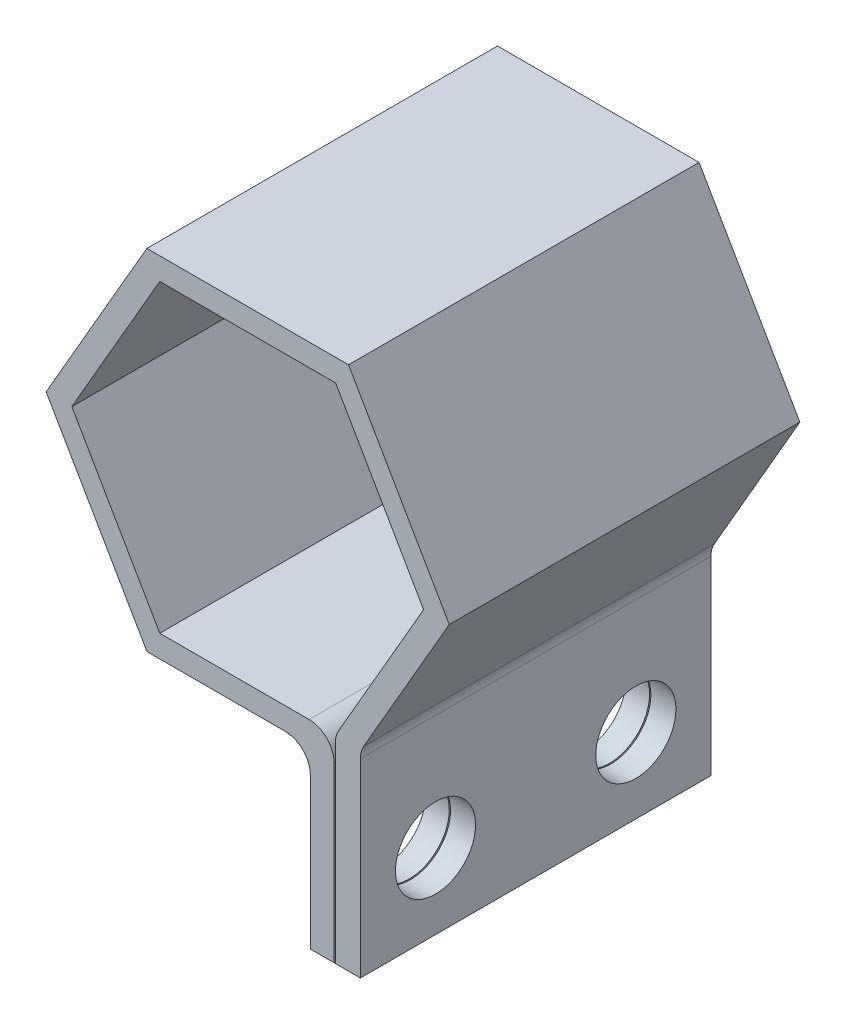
from build123d import *

# Parameters (mm, degrees)
BOSS_EXTRUDE1_DEPTH = 14
CUT_EXTRUDE1_REACH  = 25.441
SKETCH2_R           = 1.6


with BuildPart() as part:
    # Sketch1 → Boss-Extrude1 (new body)
    with BuildSketch(Plane.XY):
        with BuildLine():
            Line((8.05, 0), (4.025, 6.9715045))
            Line((4.025, 6.9715045), (-4.025, 6.9715045))
            Line((-4.025, 6.9715045), (-8.05, 0))
            Line((-8.05, 0), (-4.025, -6.9715045))
            Line((-4.025, -6.9715045), (1.5, -6.9715045))
            ThreePointArc((1.5, -6.9715045), (2.207106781, -7.264397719), (2.5, -7.9715045))
            Line((2.5, -7.9715045), (2.5, -14))
            Line((2.5, -14), (3.45, -14))
            Line((3.45, -14), (3.45, -7.083828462))
            ThreePointArc((3.45, -7.083828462), (3.157106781, -6.37672168), (2.45, -6.083828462))
            Line((2.45, -6.083828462), (-3.5125, -6.083828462))
            Line((-3.5125, -6.083828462), (-7.025, 0))
            Line((-7.025, 0), (-3.5125, 6.083828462))
            Line((-3.5125, 6.083828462), (3.5125, 6.083828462))
            Line((3.5125, 6.083828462), (7.025, 0))
            Line((7.025, 0), (3.633974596, -5.873428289))
            ThreePointArc((3.633974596, -5.873428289), (3.534074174, -6.114609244), (3.5, -6.373428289))
            Line((3.5, -6.373428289), (3.5, -14))
            Line((3.5, -14), (4.5, -14))
            Line((4.5, -14), (4.5, -6.416729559))
            ThreePointArc((4.5, -6.416729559), (4.534074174, -6.157910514), (4.633974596, -5.916729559))
            Line((4.633974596, -5.916729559), (8.05, 0))
        make_face()
    extrude(amount=BOSS_EXTRUDE1_DEPTH)

    # Cut-Extrude1: up to this face of the body (flat: up to its plane)
    cut_extrude1_end = Plane(part.part.faces().sort_by_distance((2.5, -10.98575225, 7))[0])
    # Sketch2 → Cut-Extrude1 (cut, up to the picked face)
    with BuildSketch(Plane(origin=(4.5, 0, 0), x_dir=(0, 0, -1), z_dir=(1, 0, 0)), mode=Mode.PRIVATE) as cut_extrude1_sk1:
        with Locations(Location((-11, -11, 0), (0, 0, 90))):
            Circle(SKETCH2_R)
    cut_extrude1_tool1 = split(extrude(cut_extrude1_sk1.sketch, amount=-CUT_EXTRUDE1_REACH, mode=Mode.PRIVATE), bisect_by=cut_extrude1_end, keep=Keep.BOTH, mode=Mode.PRIVATE)
    # Sketch2 → Cut-Extrude1 (cut, up to the picked face)
    with BuildSketch(Plane(origin=(4.5, 0, 0), x_dir=(0, 0, -1), z_dir=(1, 0, 0)), mode=Mode.PRIVATE) as cut_extrude1_sk2:
        with Locations(Location((-3, -11, 0), (0, 0, 90))):
            Circle(SKETCH2_R)
    cut_extrude1_tool2 = split(extrude(cut_extrude1_sk2.sketch, amount=-CUT_EXTRUDE1_REACH, mode=Mode.PRIVATE), bisect_by=cut_extrude1_end, keep=Keep.BOTH, mode=Mode.PRIVATE)
    add(cut_extrude1_tool1.solids().sort_by(Axis((4.5, -11, 11), (-1, 0, 0)))[0], mode=Mode.SUBTRACT)
    add(cut_extrude1_tool2.solids().sort_by(Axis((4.5, -11, 3), (-1, 0, 0)))[0], mode=Mode.SUBTRACT)


solid = part.part
